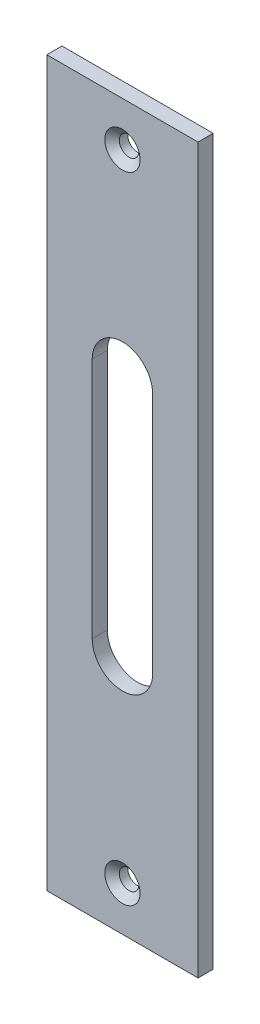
from build123d import *

# Parameters (mm, degrees)
SKETCH1_W                                         = 15.875
SKETCH1_H                                         = 76
EXTRUDE1_DEPTH                                    = 1.5875
CUT_EXTRUDE1_DEPTH                                = 39.852594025
CSK_FOR_1_FLAT_HEAD_MACHINE_SCREW_100_D           = 2.0574
CSK_FOR_1_FLAT_HEAD_MACHINE_SCREW_100_DEPTH       = 25.4
CSK_FOR_1_FLAT_HEAD_MACHINE_SCREW_100_CSINK_D     = 3.7084
CSK_FOR_1_FLAT_HEAD_MACHINE_SCREW_100_CSINK_ANGLE = 100
CSK_FOR_1_FLAT_HEAD_MACHINE_SCREW_100_TIP         = 0.618105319


with BuildPart() as part:
    # Sketch1 → Extrude1 (new body)
    with BuildSketch(Plane.XY):
        Rectangle(SKETCH1_W, SKETCH1_H)
    extrude(amount=EXTRUDE1_DEPTH)

    # Sketch2 → Cut-Extrude1 (cut, through all)
    with BuildSketch(Plane.XY.offset(1.5875)):
        with BuildLine():
            Line((-3.175, -12.7), (-3.175, 12.7))
            ThreePointArc((-3.175, 12.7), (0, 15.875), (3.175, 12.7))
            Line((3.175, 12.7), (3.175, -12.7))
            ThreePointArc((3.175, -12.7), (0, -15.875), (-3.175, -12.7))
        make_face()
    extrude(amount=-CUT_EXTRUDE1_DEPTH, mode=Mode.SUBTRACT)

    # CSK for _1 Flat Head Machine Screw _100
    with Locations(Plane.XY.offset(1.5875)):
        with Locations((0, 33.3375), (0, -33.3375)):
            CounterSinkHole(CSK_FOR_1_FLAT_HEAD_MACHINE_SCREW_100_D / 2, CSK_FOR_1_FLAT_HEAD_MACHINE_SCREW_100_CSINK_D / 2, depth=CSK_FOR_1_FLAT_HEAD_MACHINE_SCREW_100_DEPTH, counter_sink_angle=CSK_FOR_1_FLAT_HEAD_MACHINE_SCREW_100_CSINK_ANGLE)
            with Locations((0, 0, -(CSK_FOR_1_FLAT_HEAD_MACHINE_SCREW_100_DEPTH + CSK_FOR_1_FLAT_HEAD_MACHINE_SCREW_100_TIP / 2))):  # 118° drill point
                Cone(0, CSK_FOR_1_FLAT_HEAD_MACHINE_SCREW_100_D / 2, CSK_FOR_1_FLAT_HEAD_MACHINE_SCREW_100_TIP, mode=Mode.SUBTRACT)


solid = part.part
